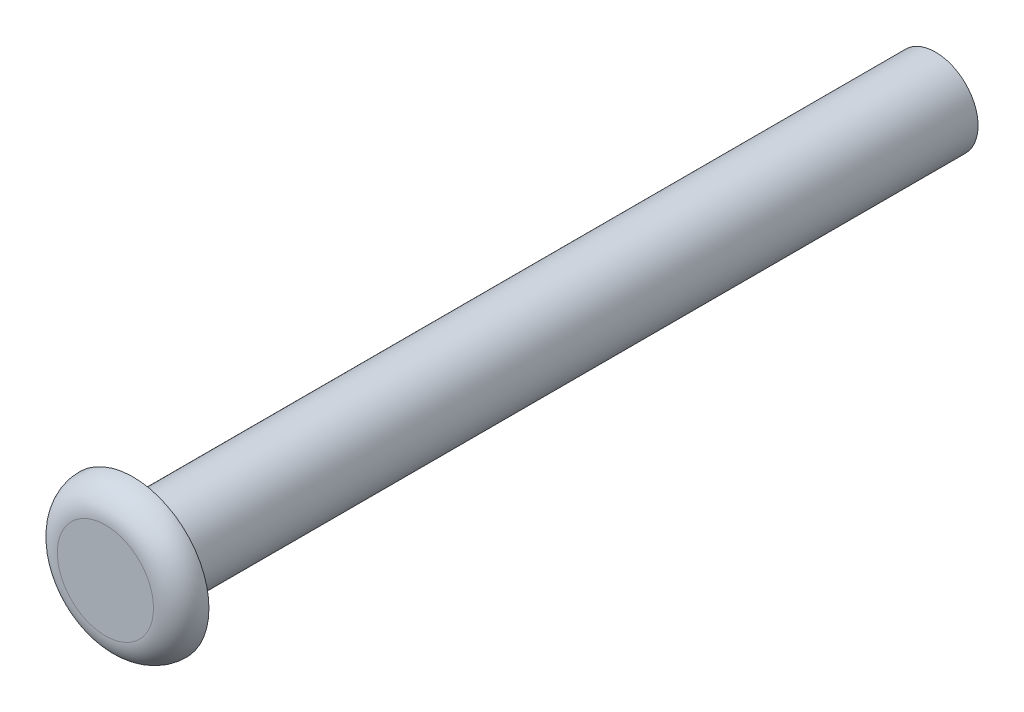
ISO-10303-21;
HEADER;
FILE_DESCRIPTION(('STEP AP214'),'2;1');
FILE_NAME('part.step','',(''),(''),'','','');
FILE_SCHEMA(('AUTOMOTIVE_DESIGN { 1 0 10303 214 1 1 1 1 }'));
ENDSEC;
DATA;
#1=APPLICATION_CONTEXT('core data for automotive mechanical design processes');
#2=APPLICATION_PROTOCOL_DEFINITION('international standard','automotive_design',2000,#1);
#3=PRODUCT_CONTEXT('',#1,'mechanical');
#4=PRODUCT('Part','Part','',(#3));
#5=PRODUCT_RELATED_PRODUCT_CATEGORY('part','',(#4));
#6=PRODUCT_DEFINITION_FORMATION('','',#4);
#7=PRODUCT_DEFINITION_CONTEXT('part definition',#1,'design');
#8=PRODUCT_DEFINITION('design','',#6,#7);
#9=PRODUCT_DEFINITION_SHAPE('','',#8);
#10=(LENGTH_UNIT() NAMED_UNIT(*) SI_UNIT(.MILLI.,.METRE.));
#11=(NAMED_UNIT(*) PLANE_ANGLE_UNIT() SI_UNIT($,.RADIAN.));
#12=(NAMED_UNIT(*) SI_UNIT($,.STERADIAN.) SOLID_ANGLE_UNIT());
#13=UNCERTAINTY_MEASURE_WITH_UNIT(LENGTH_MEASURE(1.E-05),#10,'distance_accuracy_value','');
#14=(GEOMETRIC_REPRESENTATION_CONTEXT(3) GLOBAL_UNCERTAINTY_ASSIGNED_CONTEXT((#13)) GLOBAL_UNIT_ASSIGNED_CONTEXT((#10,
#11,#12)) REPRESENTATION_CONTEXT('',''));
#15=CARTESIAN_POINT('',(0.,0.,0.));
#16=DIRECTION('',(0.,0.,1.));
#17=DIRECTION('',(1.,0.,0.));
#18=AXIS2_PLACEMENT_3D('',#15,#16,#17);
#19=CARTESIAN_POINT('',(0.,0.,45.6438));
#20=DIRECTION('',(0.,0.,1.));
#21=DIRECTION('',(1.,0.,0.));
#22=AXIS2_PLACEMENT_3D('',#19,#20,#21);
#23=PLANE('',#22);
#24=CARTESIAN_POINT('',(0.,0.,45.6438));
#25=DIRECTION('',(0.,0.,-1.));
#26=DIRECTION('',(1.,0.,0.));
#27=AXIS2_PLACEMENT_3D('',#24,#25,#26);
#28=CIRCLE('',#27,2.6431875);
#29=CARTESIAN_POINT('',(2.6431875,0.,45.6438));
#30=VERTEX_POINT('',#29);
#31=EDGE_CURVE('E36',#30,#30,#28,.T.);
#32=ORIENTED_EDGE('',*,*,#31,.F.);
#33=EDGE_LOOP('',(#32));
#34=FACE_BOUND('',#33,.T.);
#35=ADVANCED_FACE('F16',(#34),#23,.T.);
#36=CARTESIAN_POINT('',(0.,0.,3.96875003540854));
#37=DIRECTION('',(0.,0.,-1.));
#38=DIRECTION('',(-1.,0.,0.));
#39=AXIS2_PLACEMENT_3D('',#36,#37,#38);
#40=CONICAL_SURFACE('',#39,1.72720000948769,1.3089969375);
#41=CARTESIAN_POINT('',(0.,0.,4.43155188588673));
#42=VERTEX_POINT('',#41);
#43=VERTEX_LOOP('',#42);
#44=FACE_BOUND('',#43,.T.);
#45=CARTESIAN_POINT('',(0.,0.,3.96875));
#46=DIRECTION('',(0.,0.,-1.));
#47=DIRECTION('',(-1.,0.,0.));
#48=AXIS2_PLACEMENT_3D('',#45,#46,#47);
#49=CIRCLE('',#48,1.7272);
#50=CARTESIAN_POINT('',(-1.7272,0.,3.96875));
#51=VERTEX_POINT('',#50);
#52=EDGE_CURVE('E34',#51,#51,#49,.T.);
#53=ORIENTED_EDGE('',*,*,#52,.T.);
#54=EDGE_LOOP('',(#53));
#55=FACE_BOUND('',#54,.T.);
#56=ADVANCED_FACE('F28',(#44,#55),#40,.F.);
#57=CARTESIAN_POINT('',(0.,0.,44.1198));
#58=DIRECTION('',(0.,0.,1.));
#59=DIRECTION('',(1.,0.,0.));
#60=AXIS2_PLACEMENT_3D('',#57,#58,#59);
#61=TOROIDAL_SURFACE('',#60,2.6431875,1.524);
#62=ORIENTED_EDGE('',*,*,#31,.T.);
#63=EDGE_LOOP('',(#62));
#64=FACE_BOUND('',#63,.T.);
#65=CARTESIAN_POINT('',(0.,0.,44.1198));
#66=DIRECTION('',(0.,0.,1.));
#67=DIRECTION('',(1.,0.,0.));
#68=AXIS2_PLACEMENT_3D('',#65,#66,#67);
#69=CIRCLE('',#68,4.1671875);
#70=CARTESIAN_POINT('',(4.1671875,0.,44.1198));
#71=VERTEX_POINT('',#70);
#72=EDGE_CURVE('E20',#71,#71,#69,.T.);
#73=ORIENTED_EDGE('',*,*,#72,.T.);
#74=EDGE_LOOP('',(#73));
#75=FACE_BOUND('',#74,.T.);
#76=ADVANCED_FACE('F31',(#64,#75),#61,.T.);
#77=CARTESIAN_POINT('',(0.,0.,0.));
#78=DIRECTION('',(0.,0.,-1.));
#79=DIRECTION('',(-1.,0.,0.));
#80=AXIS2_PLACEMENT_3D('',#77,#78,#79);
#81=CYLINDRICAL_SURFACE('',#80,1.7272);
#82=CARTESIAN_POINT('',(0.,0.,0.));
#83=DIRECTION('',(0.,0.,-1.));
#84=DIRECTION('',(-1.,0.,0.));
#85=AXIS2_PLACEMENT_3D('',#82,#83,#84);
#86=CIRCLE('',#85,1.7272);
#87=CARTESIAN_POINT('',(-1.7272,0.,0.));
#88=VERTEX_POINT('',#87);
#89=EDGE_CURVE('E39',#88,#88,#86,.T.);
#90=ORIENTED_EDGE('',*,*,#89,.T.);
#91=EDGE_LOOP('',(#90));
#92=FACE_BOUND('',#91,.T.);
#93=ORIENTED_EDGE('',*,*,#52,.F.);
#94=EDGE_LOOP('',(#93));
#95=FACE_BOUND('',#94,.T.);
#96=ADVANCED_FACE('F52',(#92,#95),#81,.F.);
#97=CARTESIAN_POINT('',(0.,0.,44.1198));
#98=DIRECTION('',(0.,0.,1.));
#99=DIRECTION('',(1.,0.,0.));
#100=AXIS2_PLACEMENT_3D('',#97,#98,#99);
#101=PLANE('',#100);
#102=CARTESIAN_POINT('',(0.,0.,44.1198));
#103=DIRECTION('',(0.,0.,-1.));
#104=DIRECTION('',(-1.,0.,0.));
#105=AXIS2_PLACEMENT_3D('',#102,#103,#104);
#106=CIRCLE('',#105,2.3368);
#107=CARTESIAN_POINT('',(-2.3368,0.,44.1198));
#108=VERTEX_POINT('',#107);
#109=EDGE_CURVE('E24',#108,#108,#106,.T.);
#110=ORIENTED_EDGE('',*,*,#109,.F.);
#111=EDGE_LOOP('',(#110));
#112=FACE_BOUND('',#111,.T.);
#113=ORIENTED_EDGE('',*,*,#72,.F.);
#114=EDGE_LOOP('',(#113));
#115=FACE_BOUND('',#114,.T.);
#116=ADVANCED_FACE('F74',(#112,#115),#101,.F.);
#117=CARTESIAN_POINT('',(0.,0.,0.));
#118=DIRECTION('',(0.,0.,1.));
#119=DIRECTION('',(1.,0.,0.));
#120=AXIS2_PLACEMENT_3D('',#117,#118,#119);
#121=PLANE('',#120);
#122=ORIENTED_EDGE('',*,*,#89,.F.);
#123=EDGE_LOOP('',(#122));
#124=FACE_BOUND('',#123,.T.);
#125=CARTESIAN_POINT('',(0.,0.,0.));
#126=DIRECTION('',(0.,0.,-1.));
#127=DIRECTION('',(-1.,0.,0.));
#128=AXIS2_PLACEMENT_3D('',#125,#126,#127);
#129=CIRCLE('',#128,2.3368);
#130=CARTESIAN_POINT('',(-2.3368,0.,0.));
#131=VERTEX_POINT('',#130);
#132=EDGE_CURVE('E11',#131,#131,#129,.F.);
#133=ORIENTED_EDGE('',*,*,#132,.F.);
#134=EDGE_LOOP('',(#133));
#135=FACE_BOUND('',#134,.T.);
#136=ADVANCED_FACE('F70',(#124,#135),#121,.F.);
#137=CARTESIAN_POINT('',(0.,0.,44.1198));
#138=DIRECTION('',(0.,0.,-1.));
#139=DIRECTION('',(-1.,0.,0.));
#140=AXIS2_PLACEMENT_3D('',#137,#138,#139);
#141=CYLINDRICAL_SURFACE('',#140,2.3368);
#142=ORIENTED_EDGE('',*,*,#132,.T.);
#143=EDGE_LOOP('',(#142));
#144=FACE_BOUND('',#143,.T.);
#145=ORIENTED_EDGE('',*,*,#109,.T.);
#146=EDGE_LOOP('',(#145));
#147=FACE_BOUND('',#146,.T.);
#148=ADVANCED_FACE('F73',(#144,#147),#141,.T.);
#149=CLOSED_SHELL('',(#35,#56,#76,#96,#116,#136,#148));
#150=MANIFOLD_SOLID_BREP('B1',#149);
#151=ADVANCED_BREP_SHAPE_REPRESENTATION('',(#18,#150),#14);
#152=SHAPE_DEFINITION_REPRESENTATION(#9,#151);
ENDSEC;
END-ISO-10303-21;
